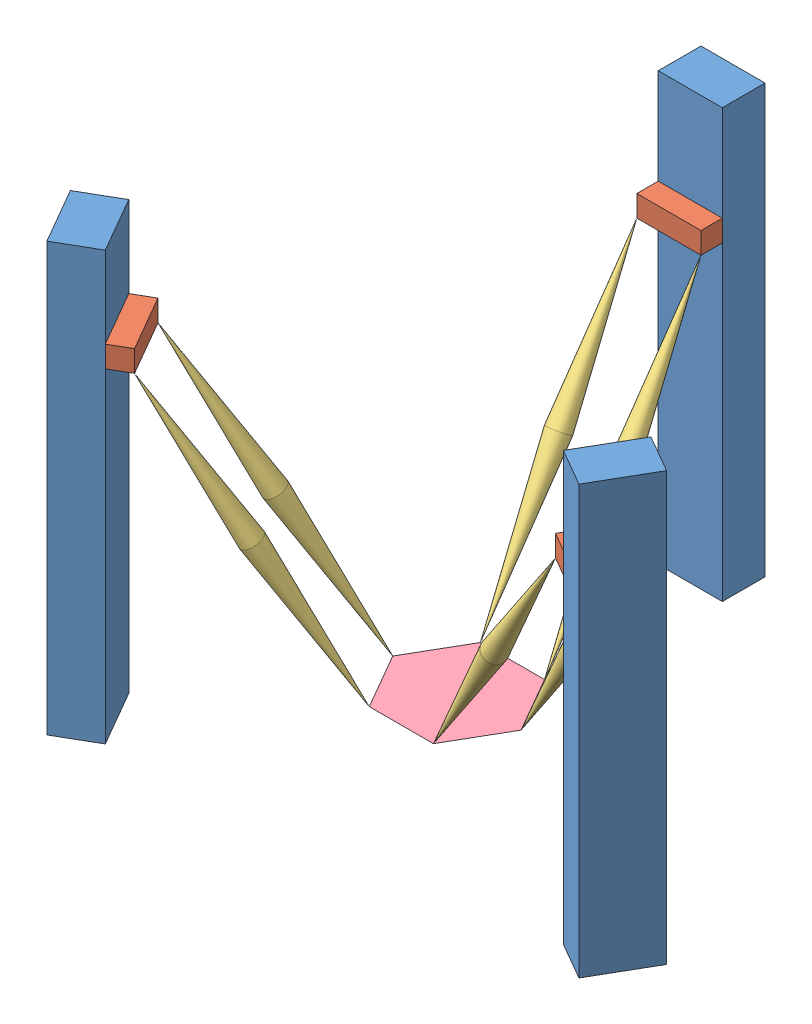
SolidWorks assembly esquema de delta.SLDASM, configuration Predeterminado (file format 7000). Lengths in mm.
Overall size (252.85 200 231.96).
11 component instances, 4 part files, 20 mates.
Components (placement in the parent):
- railes-2: railes.SLDPRT [Predeterminado] at (-215.1066 -15.5504 153.9404) size (252.85 200 231.96)
- block-1: block.SLDPRT [Predeterminado] at (-230.1066 139.7218 41.6199) x (1 0 0) z (0 -1 0) size (30 10 10)
- block-2: block.SLDPRT [Predeterminado] at (-110.3342 144.0354 197.1103) x (0.5 0 -0.866025) z (0 -1 0) size (30 10 10)
- block-3: block.SLDPRT [Predeterminado] at (-304.879 146.382 223.0911) x (0.5 0 0.866025) z (0 -1 0) size (30 10 10)
- brazos-4: brazos.SLDPRT [Predeterminado] at (-308.0489 136.382 207.6007) x (0.412639 -0.853129 -0.319219) z (0.534766 -0.056808 0.843089) size (150 10 10)
- brazos-5: brazos.SLDPRT [Predeterminado] at (-293.0489 136.382 233.5815) x (0.412639 -0.853129 -0.319219) z (0.360719 -0.168751 0.917281) size (150 10 10)
- brazos-6: brazos.SLDPRT [Predeterminado] at (-201.153 8.4127 185.6986) x (0.526591 0.837485 0.146014) z (0.135816 -0.252429 0.958036) size (150 10 10)
- brazos-7: brazos.SLDPRT [Predeterminado] at (-231.153 8.4127 133.7371) x (-0.093024 0.808727 -0.580781) z (-0.970566 -0.203797 -0.128328) size (150 10 10)
- brazos-8: brazos.SLDPRT [Predeterminado] at (-186.153 8.4127 159.7179) x (0.526591 0.837485 0.146014) z (0.569026 -0.219629 -0.792447) size (150 10 10)
- brazos-9: brazos.SLDPRT [Predeterminado] at (-215.1066 129.7218 46.6199) x (0.093024 -0.808727 0.580781) z (-0.79908 -0.408626 -0.441016) size (150 10 10)
- base-2: base.SLDPRT [Predeterminado] at (-216.153 8.4127 159.7179) x (0.878982 0 -0.476856) z (-0.476856 0 -0.878982) size (52.74 15 59.98)
Mates (geometry in assembly coordinates):
- Coincidente2: coincident anti-aligned: line of railes-2 through (-245.1066 184.4496 36.6199) axis (0 -1 0); line of block-1 through (-245.1066 129.7218 36.6199) axis (0 1 0)
- Coincidente3: coincident anti-aligned: line of railes-2 through (-215.1066 184.4496 36.6199) axis (0 -1 0); line of block-1 through (-215.1066 129.7218 36.6199) axis (0 1 0)
- Coincidente4: coincident anti-aligned: line of railes-2 through (-113.504 184.4496 212.6007) axis (0 -1 0); line of block-2 through (-113.504 134.0354 212.6007) axis (0 1 0)
- Coincidente5: coincident anti-aligned: line of railes-2 through (-98.504 184.4496 186.6199) axis (0 -1 0); line of block-2 through (-98.504 134.0354 186.6199) axis (0 1 0)
- Coincidente6: coincident anti-aligned: line of railes-2 through (-316.7091 184.4496 212.6007) axis (0 -1 0); line of block-3 through (-316.7091 136.382 212.6007) axis (0 1 0)
- Coincidente7: coincident anti-aligned: line of railes-2 through (-301.7091 184.4496 238.5815) axis (0 -1 0); line of block-3 through (-301.7091 136.382 238.5815) axis (0 1 0)
- Coincidente8: coincident: point of block-2; point of brazos-8
- Coincidente9: coincident: point of block-2; point of brazos-6
- Coincidente10: coincident: point of block-1; point of brazos-7
- Coincidente11: coincident: point of block-1; point of brazos-9
- Coincidente12: coincident: point of block-3; point of brazos-5
- Coincidente13: coincident: point of block-3; point of brazos-4
- Coincidente14: coincident: point of brazos-4; point of base-2
- Coincidente15: coincident: point of brazos-5; point of base-2
- Coincidente16: coincident: point of brazos-8; point of base-2
- Coincidente17: coincident: point of brazos-6; point of base-2
- Coincidente22: coincident: point of brazos-9; point of base-2
- Coincidente24: coincident: point of brazos-7; point of base-2
- Paralelo1: parallel anti-aligned: line of block-3 through (-308.0489 146.382 207.6007) axis (0.5 0 0.866025); line of base-2 through (-231.153 8.4127 185.6986) axis (-0.5 0 -0.866025)
- Paralelo2: parallel anti-aligned: line of block-1 through (-215.1066 139.7218 46.6199) axis (-1 0 0); line of base-2 through (-231.153 8.4127 133.7371) axis (1 0 0)
